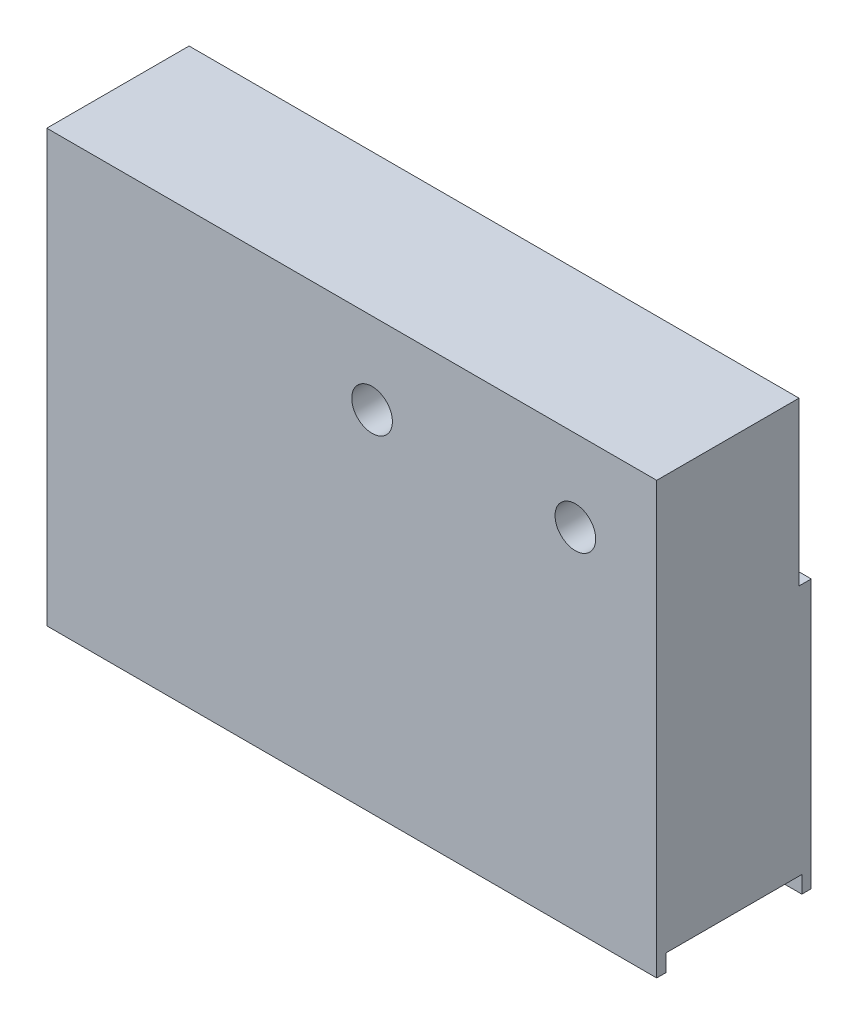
ISO-10303-21;
HEADER;
FILE_DESCRIPTION(('STEP AP214'),'2;1');
FILE_NAME('part.step','',(''),(''),'','','');
FILE_SCHEMA(('AUTOMOTIVE_DESIGN { 1 0 10303 214 1 1 1 1 }'));
ENDSEC;
DATA;
#1=APPLICATION_CONTEXT('core data for automotive mechanical design processes');
#2=APPLICATION_PROTOCOL_DEFINITION('international standard','automotive_design',2000,#1);
#3=PRODUCT_CONTEXT('',#1,'mechanical');
#4=PRODUCT('Part','Part','',(#3));
#5=PRODUCT_RELATED_PRODUCT_CATEGORY('part','',(#4));
#6=PRODUCT_DEFINITION_FORMATION('','',#4);
#7=PRODUCT_DEFINITION_CONTEXT('part definition',#1,'design');
#8=PRODUCT_DEFINITION('design','',#6,#7);
#9=PRODUCT_DEFINITION_SHAPE('','',#8);
#10=(LENGTH_UNIT() NAMED_UNIT(*) SI_UNIT(.MILLI.,.METRE.));
#11=(NAMED_UNIT(*) PLANE_ANGLE_UNIT() SI_UNIT($,.RADIAN.));
#12=(NAMED_UNIT(*) SI_UNIT($,.STERADIAN.) SOLID_ANGLE_UNIT());
#13=UNCERTAINTY_MEASURE_WITH_UNIT(LENGTH_MEASURE(1.E-05),#10,'distance_accuracy_value','');
#14=(GEOMETRIC_REPRESENTATION_CONTEXT(3) GLOBAL_UNCERTAINTY_ASSIGNED_CONTEXT((#13)) GLOBAL_UNIT_ASSIGNED_CONTEXT((#10,
#11,#12)) REPRESENTATION_CONTEXT('',''));
#15=CARTESIAN_POINT('',(0.,0.,0.));
#16=DIRECTION('',(0.,0.,1.));
#17=DIRECTION('',(1.,0.,0.));
#18=AXIS2_PLACEMENT_3D('',#15,#16,#17);
#19=CARTESIAN_POINT('',(-263.,-63.,19.));
#20=DIRECTION('',(0.,1.,0.));
#21=DIRECTION('',(-1.,0.,0.));
#22=AXIS2_PLACEMENT_3D('',#19,#20,#21);
#23=PLANE('',#22);
#24=DIRECTION('',(0.,0.,-1.));
#25=VECTOR('',#24,1.);
#26=CARTESIAN_POINT('',(-338.,-63.,19.));
#27=LINE('',#26,#25);
#28=CARTESIAN_POINT('',(-338.,-63.,19.));
#29=VERTEX_POINT('',#28);
#30=CARTESIAN_POINT('',(-338.,-63.,17.85));
#31=VERTEX_POINT('',#30);
#32=EDGE_CURVE('E120',#29,#31,#27,.T.);
#33=ORIENTED_EDGE('',*,*,#32,.T.);
#34=DIRECTION('',(1.,0.,0.));
#35=VECTOR('',#34,1.);
#36=CARTESIAN_POINT('',(-338.,-63.,17.85));
#37=LINE('',#36,#35);
#38=CARTESIAN_POINT('',(-263.,-63.,17.85));
#39=VERTEX_POINT('',#38);
#40=EDGE_CURVE('E146',#31,#39,#37,.T.);
#41=ORIENTED_EDGE('',*,*,#40,.T.);
#42=DIRECTION('',(0.,0.,-1.));
#43=VECTOR('',#42,1.);
#44=CARTESIAN_POINT('',(-263.,-63.,19.));
#45=LINE('',#44,#43);
#46=CARTESIAN_POINT('',(-263.,-63.,19.));
#47=VERTEX_POINT('',#46);
#48=EDGE_CURVE('E125',#47,#39,#45,.T.);
#49=ORIENTED_EDGE('',*,*,#48,.F.);
#50=DIRECTION('',(1.,0.,0.));
#51=VECTOR('',#50,1.);
#52=CARTESIAN_POINT('',(-263.,-63.,19.));
#53=LINE('',#52,#51);
#54=EDGE_CURVE('E139',#29,#47,#53,.T.);
#55=ORIENTED_EDGE('',*,*,#54,.F.);
#56=EDGE_LOOP('',(#33,#41,#49,#55));
#57=FACE_BOUND('',#56,.T.);
#58=ADVANCED_FACE('F16',(#57),#23,.F.);
#59=CARTESIAN_POINT('',(-263.,-10.,19.));
#60=DIRECTION('',(-1.,0.,0.));
#61=DIRECTION('',(0.,0.,1.));
#62=AXIS2_PLACEMENT_3D('',#59,#60,#61);
#63=PLANE('',#62);
#64=DIRECTION('',(0.,1.,0.));
#65=VECTOR('',#64,1.);
#66=CARTESIAN_POINT('',(-263.,-10.,0.));
#67=LINE('',#66,#65);
#68=CARTESIAN_POINT('',(-263.,-63.,0.));
#69=VERTEX_POINT('',#68);
#70=CARTESIAN_POINT('',(-263.,-30.,0.));
#71=VERTEX_POINT('',#70);
#72=EDGE_CURVE('E135',#69,#71,#67,.T.);
#73=ORIENTED_EDGE('',*,*,#72,.T.);
#74=DIRECTION('',(0.,0.,-1.));
#75=VECTOR('',#74,1.);
#76=CARTESIAN_POINT('',(-263.,-30.,0.));
#77=LINE('',#76,#75);
#78=CARTESIAN_POINT('',(-263.,-30.,1.5));
#79=VERTEX_POINT('',#78);
#80=EDGE_CURVE('E31',#79,#71,#77,.T.);
#81=ORIENTED_EDGE('',*,*,#80,.F.);
#82=DIRECTION('',(0.,-1.,0.));
#83=VECTOR('',#82,1.);
#84=CARTESIAN_POINT('',(-263.,-10.,1.5));
#85=LINE('',#84,#83);
#86=CARTESIAN_POINT('',(-263.,-10.,1.5));
#87=VERTEX_POINT('',#86);
#88=EDGE_CURVE('E185',#87,#79,#85,.T.);
#89=ORIENTED_EDGE('',*,*,#88,.F.);
#90=DIRECTION('',(0.,0.,-1.));
#91=VECTOR('',#90,1.);
#92=CARTESIAN_POINT('',(-263.,-10.,19.));
#93=LINE('',#92,#91);
#94=CARTESIAN_POINT('',(-263.,-10.,19.));
#95=VERTEX_POINT('',#94);
#96=EDGE_CURVE('E11',#95,#87,#93,.T.);
#97=ORIENTED_EDGE('',*,*,#96,.F.);
#98=DIRECTION('',(0.,1.,0.));
#99=VECTOR('',#98,1.);
#100=CARTESIAN_POINT('',(-263.,-10.,19.));
#101=LINE('',#100,#99);
#102=EDGE_CURVE('E132',#47,#95,#101,.T.);
#103=ORIENTED_EDGE('',*,*,#102,.F.);
#104=ORIENTED_EDGE('',*,*,#48,.T.);
#105=DIRECTION('',(0.,-1.,0.));
#106=VECTOR('',#105,1.);
#107=CARTESIAN_POINT('',(-263.,-63.,17.85));
#108=LINE('',#107,#106);
#109=CARTESIAN_POINT('',(-263.,-60.9,17.85));
#110=VERTEX_POINT('',#109);
#111=EDGE_CURVE('E162',#110,#39,#108,.T.);
#112=ORIENTED_EDGE('',*,*,#111,.F.);
#113=DIRECTION('',(0.,0.,1.));
#114=VECTOR('',#113,1.);
#115=CARTESIAN_POINT('',(-263.,-60.9,17.85));
#116=LINE('',#115,#114);
#117=CARTESIAN_POINT('',(-263.,-60.9,1.15));
#118=VERTEX_POINT('',#117);
#119=EDGE_CURVE('E155',#118,#110,#116,.T.);
#120=ORIENTED_EDGE('',*,*,#119,.F.);
#121=DIRECTION('',(0.,1.,0.));
#122=VECTOR('',#121,1.);
#123=CARTESIAN_POINT('',(-263.,-63.,1.15));
#124=LINE('',#123,#122);
#125=CARTESIAN_POINT('',(-263.,-63.,1.15));
#126=VERTEX_POINT('',#125);
#127=EDGE_CURVE('E159',#126,#118,#124,.T.);
#128=ORIENTED_EDGE('',*,*,#127,.F.);
#129=EDGE_CURVE('E128',#126,#69,#45,.T.);
#130=ORIENTED_EDGE('',*,*,#129,.T.);
#131=EDGE_LOOP('',(#73,#81,#89,#97,#103,#104,#112,#120,#128,#130));
#132=FACE_BOUND('',#131,.T.);
#133=ADVANCED_FACE('F18',(#132),#63,.F.);
#134=CARTESIAN_POINT('',(-263.,-10.,19.));
#135=DIRECTION('',(0.,-1.,0.));
#136=DIRECTION('',(1.,0.,0.));
#137=AXIS2_PLACEMENT_3D('',#134,#135,#136);
#138=PLANE('',#137);
#139=ORIENTED_EDGE('',*,*,#96,.T.);
#140=DIRECTION('',(1.,0.,0.));
#141=VECTOR('',#140,1.);
#142=CARTESIAN_POINT('',(-338.,-10.,1.5));
#143=LINE('',#142,#141);
#144=CARTESIAN_POINT('',(-338.,-10.,1.5));
#145=VERTEX_POINT('',#144);
#146=EDGE_CURVE('E102',#145,#87,#143,.T.);
#147=ORIENTED_EDGE('',*,*,#146,.F.);
#148=DIRECTION('',(0.,0.,-1.));
#149=VECTOR('',#148,1.);
#150=CARTESIAN_POINT('',(-338.,-10.,19.));
#151=LINE('',#150,#149);
#152=CARTESIAN_POINT('',(-338.,-10.,19.));
#153=VERTEX_POINT('',#152);
#154=EDGE_CURVE('E24',#153,#145,#151,.T.);
#155=ORIENTED_EDGE('',*,*,#154,.F.);
#156=DIRECTION('',(-1.,0.,0.));
#157=VECTOR('',#156,1.);
#158=CARTESIAN_POINT('',(-263.,-10.,19.));
#159=LINE('',#158,#157);
#160=EDGE_CURVE('E142',#95,#153,#159,.T.);
#161=ORIENTED_EDGE('',*,*,#160,.F.);
#162=EDGE_LOOP('',(#139,#147,#155,#161));
#163=FACE_BOUND('',#162,.T.);
#164=ADVANCED_FACE('F113',(#163),#138,.F.);
#165=CARTESIAN_POINT('',(-338.,-10.,19.));
#166=DIRECTION('',(1.,0.,0.));
#167=DIRECTION('',(0.,0.,-1.));
#168=AXIS2_PLACEMENT_3D('',#165,#166,#167);
#169=PLANE('',#168);
#170=DIRECTION('',(0.,-1.,0.));
#171=VECTOR('',#170,1.);
#172=CARTESIAN_POINT('',(-338.,-10.,1.5));
#173=LINE('',#172,#171);
#174=CARTESIAN_POINT('',(-338.,-30.,1.5));
#175=VERTEX_POINT('',#174);
#176=EDGE_CURVE('E98',#145,#175,#173,.T.);
#177=ORIENTED_EDGE('',*,*,#176,.T.);
#178=DIRECTION('',(0.,0.,-1.));
#179=VECTOR('',#178,1.);
#180=CARTESIAN_POINT('',(-338.,-30.,0.));
#181=LINE('',#180,#179);
#182=CARTESIAN_POINT('',(-338.,-30.,0.));
#183=VERTEX_POINT('',#182);
#184=EDGE_CURVE('E109',#175,#183,#181,.T.);
#185=ORIENTED_EDGE('',*,*,#184,.T.);
#186=DIRECTION('',(0.,-1.,0.));
#187=VECTOR('',#186,1.);
#188=CARTESIAN_POINT('',(-338.,-10.,0.));
#189=LINE('',#188,#187);
#190=CARTESIAN_POINT('',(-338.,-63.,0.));
#191=VERTEX_POINT('',#190);
#192=EDGE_CURVE('E133',#183,#191,#189,.T.);
#193=ORIENTED_EDGE('',*,*,#192,.T.);
#194=CARTESIAN_POINT('',(-338.,-63.,1.15));
#195=VERTEX_POINT('',#194);
#196=EDGE_CURVE('E122',#195,#191,#27,.T.);
#197=ORIENTED_EDGE('',*,*,#196,.F.);
#198=DIRECTION('',(0.,1.,0.));
#199=VECTOR('',#198,1.);
#200=CARTESIAN_POINT('',(-338.,-63.,1.15));
#201=LINE('',#200,#199);
#202=CARTESIAN_POINT('',(-338.,-60.9,1.15));
#203=VERTEX_POINT('',#202);
#204=EDGE_CURVE('E39',#195,#203,#201,.T.);
#205=ORIENTED_EDGE('',*,*,#204,.T.);
#206=DIRECTION('',(0.,0.,1.));
#207=VECTOR('',#206,1.);
#208=CARTESIAN_POINT('',(-338.,-60.9,17.85));
#209=LINE('',#208,#207);
#210=CARTESIAN_POINT('',(-338.,-60.9,17.85));
#211=VERTEX_POINT('',#210);
#212=EDGE_CURVE('E150',#203,#211,#209,.T.);
#213=ORIENTED_EDGE('',*,*,#212,.T.);
#214=DIRECTION('',(0.,-1.,0.));
#215=VECTOR('',#214,1.);
#216=CARTESIAN_POINT('',(-338.,-63.,17.85));
#217=LINE('',#216,#215);
#218=EDGE_CURVE('E158',#211,#31,#217,.T.);
#219=ORIENTED_EDGE('',*,*,#218,.T.);
#220=ORIENTED_EDGE('',*,*,#32,.F.);
#221=DIRECTION('',(0.,-1.,0.));
#222=VECTOR('',#221,1.);
#223=CARTESIAN_POINT('',(-338.,-10.,19.));
#224=LINE('',#223,#222);
#225=EDGE_CURVE('E119',#153,#29,#224,.T.);
#226=ORIENTED_EDGE('',*,*,#225,.F.);
#227=ORIENTED_EDGE('',*,*,#154,.T.);
#228=EDGE_LOOP('',(#177,#185,#193,#197,#205,#213,#219,#220,#226,#227));
#229=FACE_BOUND('',#228,.T.);
#230=ADVANCED_FACE('F117',(#229),#169,.F.);
#231=ORIENTED_EDGE('',*,*,#129,.F.);
#232=DIRECTION('',(1.,0.,0.));
#233=VECTOR('',#232,1.);
#234=CARTESIAN_POINT('',(-338.,-63.,1.15));
#235=LINE('',#234,#233);
#236=EDGE_CURVE('E149',#195,#126,#235,.T.);
#237=ORIENTED_EDGE('',*,*,#236,.F.);
#238=ORIENTED_EDGE('',*,*,#196,.T.);
#239=DIRECTION('',(1.,0.,0.));
#240=VECTOR('',#239,1.);
#241=CARTESIAN_POINT('',(-263.,-63.,0.));
#242=LINE('',#241,#240);
#243=EDGE_CURVE('E129',#191,#69,#242,.T.);
#244=ORIENTED_EDGE('',*,*,#243,.T.);
#245=EDGE_LOOP('',(#231,#237,#238,#244));
#246=FACE_BOUND('',#245,.T.);
#247=ADVANCED_FACE('F225',(#246),#23,.F.);
#248=CARTESIAN_POINT('',(0.,0.,19.));
#249=DIRECTION('',(0.,0.,-1.));
#250=DIRECTION('',(-1.,0.,0.));
#251=AXIS2_PLACEMENT_3D('',#248,#249,#250);
#252=PLANE('',#251);
#253=CARTESIAN_POINT('',(-273.,-20.,19.));
#254=DIRECTION('',(0.,0.,-1.));
#255=DIRECTION('',(0.,1.,0.));
#256=AXIS2_PLACEMENT_3D('',#253,#254,#255);
#257=CIRCLE('',#256,2.5);
#258=CARTESIAN_POINT('',(-273.,-17.5,19.));
#259=VERTEX_POINT('',#258);
#260=EDGE_CURVE('E194',#259,#259,#257,.T.);
#261=ORIENTED_EDGE('',*,*,#260,.T.);
#262=EDGE_LOOP('',(#261));
#263=FACE_BOUND('',#262,.T.);
#264=CARTESIAN_POINT('',(-298.,-20.,19.));
#265=DIRECTION('',(0.,0.,-1.));
#266=DIRECTION('',(0.,1.,0.));
#267=AXIS2_PLACEMENT_3D('',#264,#265,#266);
#268=CIRCLE('',#267,2.5);
#269=CARTESIAN_POINT('',(-298.,-17.5,19.));
#270=VERTEX_POINT('',#269);
#271=EDGE_CURVE('E187',#270,#270,#268,.T.);
#272=ORIENTED_EDGE('',*,*,#271,.T.);
#273=EDGE_LOOP('',(#272));
#274=FACE_BOUND('',#273,.T.);
#275=ORIENTED_EDGE('',*,*,#102,.T.);
#276=ORIENTED_EDGE('',*,*,#160,.T.);
#277=ORIENTED_EDGE('',*,*,#225,.T.);
#278=ORIENTED_EDGE('',*,*,#54,.T.);
#279=EDGE_LOOP('',(#275,#276,#277,#278));
#280=FACE_BOUND('',#279,.T.);
#281=ADVANCED_FACE('F234',(#263,#274,#280),#252,.F.);
#282=CARTESIAN_POINT('',(0.,0.,0.));
#283=DIRECTION('',(0.,0.,-1.));
#284=DIRECTION('',(-1.,0.,0.));
#285=AXIS2_PLACEMENT_3D('',#282,#283,#284);
#286=PLANE('',#285);
#287=DIRECTION('',(1.,0.,0.));
#288=VECTOR('',#287,1.);
#289=CARTESIAN_POINT('',(-338.,-30.,0.));
#290=LINE('',#289,#288);
#291=EDGE_CURVE('E180',#183,#71,#290,.T.);
#292=ORIENTED_EDGE('',*,*,#291,.T.);
#293=ORIENTED_EDGE('',*,*,#72,.F.);
#294=ORIENTED_EDGE('',*,*,#243,.F.);
#295=ORIENTED_EDGE('',*,*,#192,.F.);
#296=EDGE_LOOP('',(#292,#293,#294,#295));
#297=FACE_BOUND('',#296,.T.);
#298=ADVANCED_FACE('F241',(#297),#286,.T.);
#299=CARTESIAN_POINT('',(-338.,-63.,17.85));
#300=DIRECTION('',(0.,0.,1.));
#301=DIRECTION('',(1.,0.,0.));
#302=AXIS2_PLACEMENT_3D('',#299,#300,#301);
#303=PLANE('',#302);
#304=ORIENTED_EDGE('',*,*,#111,.T.);
#305=ORIENTED_EDGE('',*,*,#40,.F.);
#306=ORIENTED_EDGE('',*,*,#218,.F.);
#307=DIRECTION('',(1.,0.,0.));
#308=VECTOR('',#307,1.);
#309=CARTESIAN_POINT('',(-338.,-60.9,17.85));
#310=LINE('',#309,#308);
#311=EDGE_CURVE('E138',#211,#110,#310,.T.);
#312=ORIENTED_EDGE('',*,*,#311,.T.);
#313=EDGE_LOOP('',(#304,#305,#306,#312));
#314=FACE_BOUND('',#313,.T.);
#315=ADVANCED_FACE('F264',(#314),#303,.F.);
#316=CARTESIAN_POINT('',(-338.,-60.9,17.85));
#317=DIRECTION('',(0.,1.,0.));
#318=DIRECTION('',(0.,0.,1.));
#319=AXIS2_PLACEMENT_3D('',#316,#317,#318);
#320=PLANE('',#319);
#321=CARTESIAN_POINT('',(-270.,-60.9,14.0000004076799));
#322=DIRECTION('',(0.,-1.,0.));
#323=DIRECTION('',(0.,0.,-1.));
#324=AXIS2_PLACEMENT_3D('',#321,#322,#323);
#325=CIRCLE('',#324,1.24999999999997);
#326=CARTESIAN_POINT('',(-270.,-60.9,12.75000040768));
#327=VERTEX_POINT('',#326);
#328=EDGE_CURVE('E178',#327,#327,#325,.T.);
#329=ORIENTED_EDGE('',*,*,#328,.F.);
#330=EDGE_LOOP('',(#329));
#331=FACE_BOUND('',#330,.T.);
#332=CARTESIAN_POINT('',(-270.,-60.9,5.00000040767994));
#333=DIRECTION('',(0.,-1.,0.));
#334=DIRECTION('',(0.,0.,-1.));
#335=AXIS2_PLACEMENT_3D('',#332,#333,#334);
#336=CIRCLE('',#335,1.24999999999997);
#337=CARTESIAN_POINT('',(-270.,-60.9,3.75000040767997));
#338=VERTEX_POINT('',#337);
#339=EDGE_CURVE('E172',#338,#338,#336,.T.);
#340=ORIENTED_EDGE('',*,*,#339,.F.);
#341=EDGE_LOOP('',(#340));
#342=FACE_BOUND('',#341,.T.);
#343=ORIENTED_EDGE('',*,*,#119,.T.);
#344=ORIENTED_EDGE('',*,*,#311,.F.);
#345=ORIENTED_EDGE('',*,*,#212,.F.);
#346=DIRECTION('',(1.,0.,0.));
#347=VECTOR('',#346,1.);
#348=CARTESIAN_POINT('',(-338.,-60.9,1.15));
#349=LINE('',#348,#347);
#350=EDGE_CURVE('E152',#203,#118,#349,.T.);
#351=ORIENTED_EDGE('',*,*,#350,.T.);
#352=EDGE_LOOP('',(#343,#344,#345,#351));
#353=FACE_BOUND('',#352,.T.);
#354=ADVANCED_FACE('F255',(#331,#342,#353),#320,.F.);
#355=CARTESIAN_POINT('',(-338.,-63.,1.15));
#356=DIRECTION('',(0.,0.,-1.));
#357=DIRECTION('',(-1.,0.,0.));
#358=AXIS2_PLACEMENT_3D('',#355,#356,#357);
#359=PLANE('',#358);
#360=ORIENTED_EDGE('',*,*,#127,.T.);
#361=ORIENTED_EDGE('',*,*,#350,.F.);
#362=ORIENTED_EDGE('',*,*,#204,.F.);
#363=ORIENTED_EDGE('',*,*,#236,.T.);
#364=EDGE_LOOP('',(#360,#361,#362,#363));
#365=FACE_BOUND('',#364,.T.);
#366=ADVANCED_FACE('F252',(#365),#359,.F.);
#367=CARTESIAN_POINT('',(-270.,-46.4,5.00000040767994));
#368=DIRECTION('',(0.,-1.,0.));
#369=DIRECTION('',(0.,0.,-1.));
#370=AXIS2_PLACEMENT_3D('',#367,#368,#369);
#371=CONICAL_SURFACE('',#370,1.24999999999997,1.02974425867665);
#372=CARTESIAN_POINT('',(-270.,-45.6489242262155,5.00000040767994));
#373=VERTEX_POINT('',#372);
#374=VERTEX_LOOP('',#373);
#375=FACE_BOUND('',#374,.T.);
#376=CARTESIAN_POINT('',(-270.,-46.4,5.00000040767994));
#377=DIRECTION('',(0.,-1.,0.));
#378=DIRECTION('',(0.,0.,-1.));
#379=AXIS2_PLACEMENT_3D('',#376,#377,#378);
#380=CIRCLE('',#379,1.24999999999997);
#381=CARTESIAN_POINT('',(-270.,-46.4,3.75000040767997));
#382=VERTEX_POINT('',#381);
#383=EDGE_CURVE('E164',#382,#382,#380,.T.);
#384=ORIENTED_EDGE('',*,*,#383,.T.);
#385=EDGE_LOOP('',(#384));
#386=FACE_BOUND('',#385,.T.);
#387=ADVANCED_FACE('F276',(#375,#386),#371,.F.);
#388=CARTESIAN_POINT('',(-270.,-60.9,5.00000040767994));
#389=DIRECTION('',(0.,-1.,0.));
#390=DIRECTION('',(0.,0.,-1.));
#391=AXIS2_PLACEMENT_3D('',#388,#389,#390);
#392=CYLINDRICAL_SURFACE('',#391,1.24999999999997);
#393=ORIENTED_EDGE('',*,*,#383,.F.);
#394=EDGE_LOOP('',(#393));
#395=FACE_BOUND('',#394,.T.);
#396=ORIENTED_EDGE('',*,*,#339,.T.);
#397=EDGE_LOOP('',(#396));
#398=FACE_BOUND('',#397,.T.);
#399=ADVANCED_FACE('F280',(#395,#398),#392,.F.);
#400=CARTESIAN_POINT('',(-270.,-46.4,14.0000004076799));
#401=DIRECTION('',(0.,-1.,0.));
#402=DIRECTION('',(0.,0.,-1.));
#403=AXIS2_PLACEMENT_3D('',#400,#401,#402);
#404=CONICAL_SURFACE('',#403,1.24999999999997,1.02974425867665);
#405=CARTESIAN_POINT('',(-270.,-45.6489242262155,14.0000004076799));
#406=VERTEX_POINT('',#405);
#407=VERTEX_LOOP('',#406);
#408=FACE_BOUND('',#407,.T.);
#409=CARTESIAN_POINT('',(-270.,-46.4,14.0000004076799));
#410=DIRECTION('',(0.,-1.,0.));
#411=DIRECTION('',(0.,0.,-1.));
#412=AXIS2_PLACEMENT_3D('',#409,#410,#411);
#413=CIRCLE('',#412,1.24999999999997);
#414=CARTESIAN_POINT('',(-270.,-46.4,12.75000040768));
#415=VERTEX_POINT('',#414);
#416=EDGE_CURVE('E175',#415,#415,#413,.T.);
#417=ORIENTED_EDGE('',*,*,#416,.T.);
#418=EDGE_LOOP('',(#417));
#419=FACE_BOUND('',#418,.T.);
#420=ADVANCED_FACE('F284',(#408,#419),#404,.F.);
#421=CARTESIAN_POINT('',(-270.,-60.9,14.0000004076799));
#422=DIRECTION('',(0.,-1.,0.));
#423=DIRECTION('',(0.,0.,-1.));
#424=AXIS2_PLACEMENT_3D('',#421,#422,#423);
#425=CYLINDRICAL_SURFACE('',#424,1.24999999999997);
#426=ORIENTED_EDGE('',*,*,#416,.F.);
#427=EDGE_LOOP('',(#426));
#428=FACE_BOUND('',#427,.T.);
#429=ORIENTED_EDGE('',*,*,#328,.T.);
#430=EDGE_LOOP('',(#429));
#431=FACE_BOUND('',#430,.T.);
#432=ADVANCED_FACE('F288',(#428,#431),#425,.F.);
#433=CARTESIAN_POINT('',(-338.,-30.,0.));
#434=DIRECTION('',(0.,-1.,0.));
#435=DIRECTION('',(0.,0.,-1.));
#436=AXIS2_PLACEMENT_3D('',#433,#434,#435);
#437=PLANE('',#436);
#438=ORIENTED_EDGE('',*,*,#80,.T.);
#439=ORIENTED_EDGE('',*,*,#291,.F.);
#440=ORIENTED_EDGE('',*,*,#184,.F.);
#441=DIRECTION('',(1.,0.,0.));
#442=VECTOR('',#441,1.);
#443=CARTESIAN_POINT('',(-338.,-30.,1.5));
#444=LINE('',#443,#442);
#445=EDGE_CURVE('E104',#175,#79,#444,.T.);
#446=ORIENTED_EDGE('',*,*,#445,.T.);
#447=EDGE_LOOP('',(#438,#439,#440,#446));
#448=FACE_BOUND('',#447,.T.);
#449=ADVANCED_FACE('F206',(#448),#437,.F.);
#450=CARTESIAN_POINT('',(-338.,-10.,1.5));
#451=DIRECTION('',(0.,0.,1.));
#452=DIRECTION('',(0.,-1.,0.));
#453=AXIS2_PLACEMENT_3D('',#450,#451,#452);
#454=PLANE('',#453);
#455=CARTESIAN_POINT('',(-273.,-20.,1.5));
#456=DIRECTION('',(0.,0.,-1.));
#457=DIRECTION('',(0.,1.,0.));
#458=AXIS2_PLACEMENT_3D('',#455,#456,#457);
#459=CIRCLE('',#458,2.5);
#460=CARTESIAN_POINT('',(-273.,-17.5,1.5));
#461=VERTEX_POINT('',#460);
#462=EDGE_CURVE('E197',#461,#461,#459,.T.);
#463=ORIENTED_EDGE('',*,*,#462,.F.);
#464=EDGE_LOOP('',(#463));
#465=FACE_BOUND('',#464,.T.);
#466=CARTESIAN_POINT('',(-298.,-20.,1.5));
#467=DIRECTION('',(0.,0.,-1.));
#468=DIRECTION('',(0.,1.,0.));
#469=AXIS2_PLACEMENT_3D('',#466,#467,#468);
#470=CIRCLE('',#469,2.5);
#471=CARTESIAN_POINT('',(-298.,-17.5,1.5));
#472=VERTEX_POINT('',#471);
#473=EDGE_CURVE('E191',#472,#472,#470,.T.);
#474=ORIENTED_EDGE('',*,*,#473,.F.);
#475=EDGE_LOOP('',(#474));
#476=FACE_BOUND('',#475,.T.);
#477=ORIENTED_EDGE('',*,*,#88,.T.);
#478=ORIENTED_EDGE('',*,*,#445,.F.);
#479=ORIENTED_EDGE('',*,*,#176,.F.);
#480=ORIENTED_EDGE('',*,*,#146,.T.);
#481=EDGE_LOOP('',(#477,#478,#479,#480));
#482=FACE_BOUND('',#481,.T.);
#483=ADVANCED_FACE('F101',(#465,#476,#482),#454,.F.);
#484=CARTESIAN_POINT('',(-298.,-20.,1.5));
#485=DIRECTION('',(0.,0.,-1.));
#486=DIRECTION('',(0.,1.,0.));
#487=AXIS2_PLACEMENT_3D('',#484,#485,#486);
#488=CYLINDRICAL_SURFACE('',#487,2.5);
#489=ORIENTED_EDGE('',*,*,#271,.F.);
#490=EDGE_LOOP('',(#489));
#491=FACE_BOUND('',#490,.T.);
#492=ORIENTED_EDGE('',*,*,#473,.T.);
#493=EDGE_LOOP('',(#492));
#494=FACE_BOUND('',#493,.T.);
#495=ADVANCED_FACE('F205',(#491,#494),#488,.F.);
#496=CARTESIAN_POINT('',(-273.,-20.,1.5));
#497=DIRECTION('',(0.,0.,-1.));
#498=DIRECTION('',(0.,1.,0.));
#499=AXIS2_PLACEMENT_3D('',#496,#497,#498);
#500=CYLINDRICAL_SURFACE('',#499,2.5);
#501=ORIENTED_EDGE('',*,*,#260,.F.);
#502=EDGE_LOOP('',(#501));
#503=FACE_BOUND('',#502,.T.);
#504=ORIENTED_EDGE('',*,*,#462,.T.);
#505=EDGE_LOOP('',(#504));
#506=FACE_BOUND('',#505,.T.);
#507=ADVANCED_FACE('F201',(#503,#506),#500,.F.);
#508=CLOSED_SHELL('',(#58,#133,#164,#230,#247,#281,#298,#315,#354,#366,#387,#399,#420,#432,#449,
#483,#495,#507));
#509=MANIFOLD_SOLID_BREP('B1',#508);
#510=ADVANCED_BREP_SHAPE_REPRESENTATION('',(#18,#509),#14);
#511=SHAPE_DEFINITION_REPRESENTATION(#9,#510);
ENDSEC;
END-ISO-10303-21;
